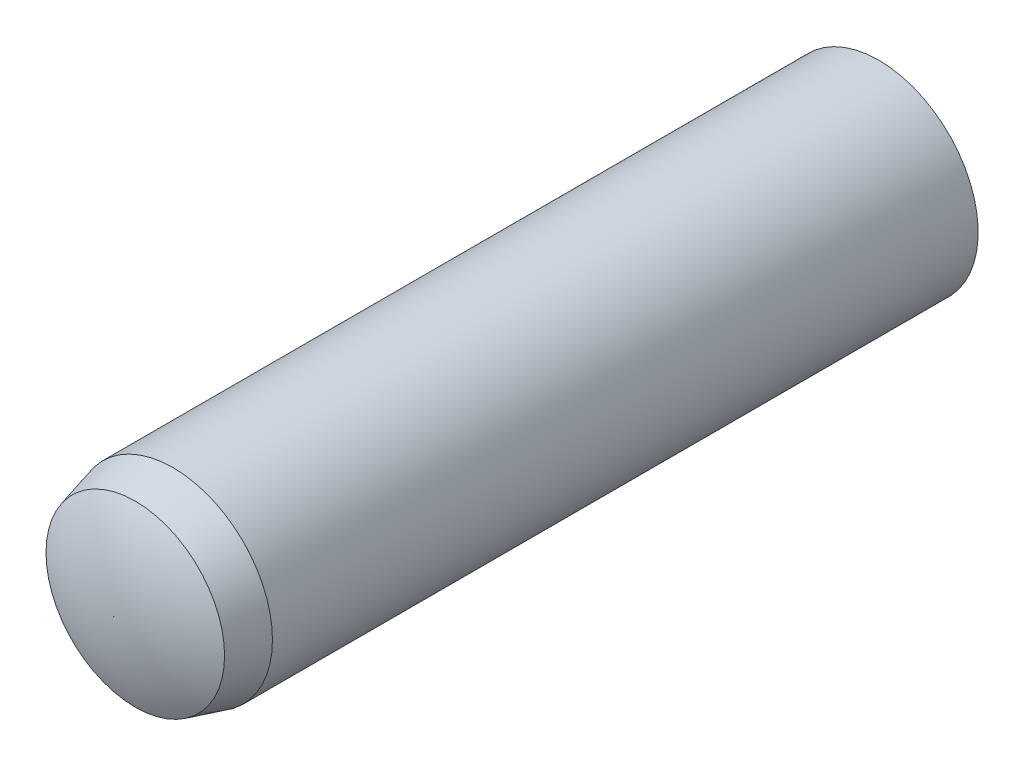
ISO-10303-21;
HEADER;
FILE_DESCRIPTION(('STEP AP214'),'2;1');
FILE_NAME('part.step','',(''),(''),'','','');
FILE_SCHEMA(('AUTOMOTIVE_DESIGN { 1 0 10303 214 1 1 1 1 }'));
ENDSEC;
DATA;
#1=APPLICATION_CONTEXT('core data for automotive mechanical design processes');
#2=APPLICATION_PROTOCOL_DEFINITION('international standard','automotive_design',2000,#1);
#3=PRODUCT_CONTEXT('',#1,'mechanical');
#4=PRODUCT('Part','Part','',(#3));
#5=PRODUCT_RELATED_PRODUCT_CATEGORY('part','',(#4));
#6=PRODUCT_DEFINITION_FORMATION('','',#4);
#7=PRODUCT_DEFINITION_CONTEXT('part definition',#1,'design');
#8=PRODUCT_DEFINITION('design','',#6,#7);
#9=PRODUCT_DEFINITION_SHAPE('','',#8);
#10=(LENGTH_UNIT() NAMED_UNIT(*) SI_UNIT(.MILLI.,.METRE.));
#11=(NAMED_UNIT(*) PLANE_ANGLE_UNIT() SI_UNIT($,.RADIAN.));
#12=(NAMED_UNIT(*) SI_UNIT($,.STERADIAN.) SOLID_ANGLE_UNIT());
#13=UNCERTAINTY_MEASURE_WITH_UNIT(LENGTH_MEASURE(1.E-05),#10,'distance_accuracy_value','');
#14=(GEOMETRIC_REPRESENTATION_CONTEXT(3) GLOBAL_UNCERTAINTY_ASSIGNED_CONTEXT((#13)) GLOBAL_UNIT_ASSIGNED_CONTEXT((#10,
#11,#12)) REPRESENTATION_CONTEXT('',''));
#15=CARTESIAN_POINT('',(0.,0.,0.));
#16=DIRECTION('',(0.,0.,1.));
#17=DIRECTION('',(1.,0.,0.));
#18=AXIS2_PLACEMENT_3D('',#15,#16,#17);
#19=CARTESIAN_POINT('',(0.,0.,20.));
#20=DIRECTION('',(0.,0.,-1.));
#21=DIRECTION('',(-1.,0.,0.));
#22=AXIS2_PLACEMENT_3D('',#19,#20,#21);
#23=CYLINDRICAL_SURFACE('',#22,5.);
#24=CARTESIAN_POINT('',(0.,0.,17.));
#25=DIRECTION('',(0.,0.,1.));
#26=DIRECTION('',(1.,0.,0.));
#27=AXIS2_PLACEMENT_3D('',#24,#25,#26);
#28=CIRCLE('',#27,5.);
#29=CARTESIAN_POINT('',(5.,0.,17.));
#30=VERTEX_POINT('',#29);
#31=EDGE_CURVE('E10',#30,#30,#28,.F.);
#32=ORIENTED_EDGE('',*,*,#31,.T.);
#33=EDGE_LOOP('',(#32));
#34=FACE_BOUND('',#33,.T.);
#35=CARTESIAN_POINT('',(0.,0.,-18.5));
#36=DIRECTION('',(0.,0.,1.));
#37=DIRECTION('',(1.,0.,0.));
#38=AXIS2_PLACEMENT_3D('',#35,#36,#37);
#39=CIRCLE('',#38,5.);
#40=CARTESIAN_POINT('',(0.,4.99999999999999,-18.5));
#41=VERTEX_POINT('',#40);
#42=EDGE_CURVE('E368',#41,#41,#39,.T.);
#43=ORIENTED_EDGE('',*,*,#42,.T.);
#44=EDGE_LOOP('',(#43));
#45=FACE_BOUND('',#44,.T.);
#46=ADVANCED_FACE('F346',(#34,#45),#23,.T.);
#47=CARTESIAN_POINT('',(0.,0.,20.));
#48=DIRECTION('',(0.,0.,-1.));
#49=DIRECTION('',(-1.,0.,0.));
#50=AXIS2_PLACEMENT_3D('',#47,#48,#49);
#51=CONICAL_SURFACE('',#50,4.19615242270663,0.261799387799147);
#52=ORIENTED_EDGE('',*,*,#31,.F.);
#53=EDGE_LOOP('',(#52));
#54=FACE_BOUND('',#53,.T.);
#55=CARTESIAN_POINT('',(0.,0.,18.9));
#56=DIRECTION('',(0.,0.,1.));
#57=DIRECTION('',(1.,0.,0.));
#58=AXIS2_PLACEMENT_3D('',#55,#56,#57);
#59=CIRCLE('',#58,4.49089653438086);
#60=CARTESIAN_POINT('',(0.,4.49089653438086,18.9));
#61=VERTEX_POINT('',#60);
#62=EDGE_CURVE('E358',#61,#61,#59,.T.);
#63=ORIENTED_EDGE('',*,*,#62,.F.);
#64=EDGE_LOOP('',(#63));
#65=FACE_BOUND('',#64,.T.);
#66=ADVANCED_FACE('F390',(#54,#65),#51,.T.);
#67=CARTESIAN_POINT('',(0.,0.,9.96513299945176));
#68=DIRECTION('',(0.,0.,1.));
#69=DIRECTION('',(0.,1.,0.));
#70=AXIS2_PLACEMENT_3D('',#67,#68,#69);
#71=SPHERICAL_SURFACE('',#70,10.);
#72=CARTESIAN_POINT('',(0.,0.,19.9651317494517));
#73=DIRECTION('',(0.,0.,1.));
#74=DIRECTION('',(1.,0.,0.));
#75=AXIS2_PLACEMENT_3D('',#72,#73,#74);
#76=CIRCLE('',#75,0.00499999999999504);
#77=CARTESIAN_POINT('',(0.,0.00500000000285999,19.9651317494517));
#78=VERTEX_POINT('',#77);
#79=EDGE_CURVE('E362',#78,#78,#76,.T.);
#80=CARTESIAN_POINT('',(0.,4.49089653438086,18.9));
#81=CARTESIAN_POINT('',(0.,4.44759536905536,18.9217643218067));
#82=CARTESIAN_POINT('',(0.,4.40413596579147,18.9432138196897));
#83=CARTESIAN_POINT('',(0.,4.31690992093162,18.9854787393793));
#84=CARTESIAN_POINT('',(0.,4.27314327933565,19.0062941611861));
#85=CARTESIAN_POINT('',(0.,4.18531199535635,19.0472865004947));
#86=CARTESIAN_POINT('',(0.,4.14124735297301,19.0674634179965));
#87=CARTESIAN_POINT('',(0.,4.05282938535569,19.107174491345));
#88=CARTESIAN_POINT('',(0.,4.00847606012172,19.1267086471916));
#89=CARTESIAN_POINT('',(0.,3.91949010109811,19.1651300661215));
#90=CARTESIAN_POINT('',(0.,3.87485746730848,19.1840173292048));
#91=CARTESIAN_POINT('',(0.,3.78532232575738,19.2211409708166));
#92=CARTESIAN_POINT('',(0.,3.74041981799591,19.2393773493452));
#93=CARTESIAN_POINT('',(0.,3.65035441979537,19.2751953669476));
#94=CARTESIAN_POINT('',(0.,3.60519152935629,19.2927770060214));
#95=CARTESIAN_POINT('',(0.,3.51461491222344,19.3272818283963));
#96=CARTESIAN_POINT('',(0.,3.46920118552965,19.3442050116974));
#97=CARTESIAN_POINT('',(0.,3.37813249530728,19.3773893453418));
#98=CARTESIAN_POINT('',(0.,3.3324775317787,19.3936504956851));
#99=CARTESIAN_POINT('',(0.,3.24093601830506,19.4255073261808));
#100=CARTESIAN_POINT('',(0.,3.19504946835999,19.4411030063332));
#101=CARTESIAN_POINT('',(0.,3.10305448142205,19.4716255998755));
#102=CARTESIAN_POINT('',(0.,3.05694604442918,19.4865525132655));
#103=CARTESIAN_POINT('',(0.,2.9645170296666,19.5157344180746));
#104=CARTESIAN_POINT('',(0.,2.9181964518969,19.5299894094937));
#105=CARTESIAN_POINT('',(0.,2.82535294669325,19.5578244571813));
#106=CARTESIAN_POINT('',(0.,2.7788300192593,19.5714045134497));
#107=CARTESIAN_POINT('',(0.,2.68559164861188,19.597886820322));
#108=CARTESIAN_POINT('',(0.,2.6388762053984,19.6107890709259));
#109=CARTESIAN_POINT('',(0.,2.54526267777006,19.635913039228));
#110=CARTESIAN_POINT('',(0.,2.4983645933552,19.6481347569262));
#111=CARTESIAN_POINT('',(0.,2.40439569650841,19.6718950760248));
#112=CARTESIAN_POINT('',(0.,2.35732488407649,19.6834336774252));
#113=CARTESIAN_POINT('',(0.,2.26302048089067,19.7058253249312));
#114=CARTESIAN_POINT('',(0.,2.21578689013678,19.7166783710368));
#115=CARTESIAN_POINT('',(0.,2.12116691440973,19.7376966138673));
#116=CARTESIAN_POINT('',(0.,2.07378052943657,19.747861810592));
#117=CARTESIAN_POINT('',(0.,1.9788649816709,19.7675022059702));
#118=CARTESIAN_POINT('',(0.,1.93133581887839,19.7769774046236));
#119=CARTESIAN_POINT('',(0.,1.83614476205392,19.7952358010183));
#120=CARTESIAN_POINT('',(0.,1.78848286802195,19.8040189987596));
#121=CARTESIAN_POINT('',(0.,1.69303642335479,19.8208915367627));
#122=CARTESIAN_POINT('',(0.,1.6452518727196,19.8289808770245));
#123=CARTESIAN_POINT('',(0.,1.54957021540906,19.8444639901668));
#124=CARTESIAN_POINT('',(0.,1.5016731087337,19.8518577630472));
#125=CARTESIAN_POINT('',(0.,1.40577646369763,19.8659481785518));
#126=CARTESIAN_POINT('',(0.,1.35777692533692,19.8726448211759));
#127=CARTESIAN_POINT('',(0.,1.26168556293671,19.8853395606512));
#128=CARTESIAN_POINT('',(0.,1.21359373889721,19.8913376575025));
#129=CARTESIAN_POINT('',(0.,1.117327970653,19.9026340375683));
#130=CARTESIAN_POINT('',(0.,1.06915402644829,19.9079323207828));
#131=CARTESIAN_POINT('',(0.,0.972734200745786,19.9178279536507));
#132=CARTESIAN_POINT('',(0.,0.924488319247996,19.922425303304));
#133=CARTESIAN_POINT('',(0.,0.827934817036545,19.9309180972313));
#134=CARTESIAN_POINT('',(0.,0.779627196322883,19.9348135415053));
#135=CARTESIAN_POINT('',(0.,0.682960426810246,19.941901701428));
#136=CARTESIAN_POINT('',(0.,0.634601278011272,19.9450944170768));
#137=CARTESIAN_POINT('',(0.,0.537841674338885,19.9507764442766));
#138=CARTESIAN_POINT('',(0.,0.489441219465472,19.9532657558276));
#139=CARTESIAN_POINT('',(0.,0.392609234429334,19.9575404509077));
#140=CARTESIAN_POINT('',(0.,0.344177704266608,19.9593258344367));
#141=CARTESIAN_POINT('',(0.,0.247293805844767,19.9621922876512));
#142=CARTESIAN_POINT('',(0.,0.198841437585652,19.9632733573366));
#143=CARTESIAN_POINT('',(0.,0.101926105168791,19.9647309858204));
#144=CARTESIAN_POINT('',(0.,0.053463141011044,19.9651075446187));
#145=CARTESIAN_POINT('',(0.,0.00500000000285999,19.9651317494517));
#146=B_SPLINE_CURVE_WITH_KNOTS('',3,(#80,#81,#82,#83,#84,#85,#86,#87,#88,#89,#90,#91,#92,#93,
#94,#95,#96,#97,#98,#99,#100,#101,#102,#103,#104,#105,#106,#107,#108,#109,#110,#111,#112,#113,
#114,#115,#116,#117,#118,#119,#120,#121,#122,#123,#124,#125,#126,#127,#128,#129,#130,#131,#132,
#133,#134,#135,#136,#137,#138,#139,#140,#141,#142,#143,#144,#145),.UNSPECIFIED.,.F.,.F.,(4,2,2,
2,2,2,2,2,2,2,2,2,2,2,2,2,2,2,2,2,2,2,2,2,2,2,2,2,2,2,2,2,4),(0.,0.145388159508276,
0.290776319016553,0.436164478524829,0.581552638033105,0.726940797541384,0.87232895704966,
1.01771711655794,1.16310527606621,1.30849343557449,1.45388159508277,1.59926975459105,
1.74465791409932,1.8900460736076,2.03543423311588,2.18082239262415,2.32621055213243,
2.47159871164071,2.61698687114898,2.76237503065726,2.90776319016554,3.05315134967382,
3.19853950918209,3.34392766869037,3.48931582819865,3.63470398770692,3.7800921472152,
3.92548030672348,4.07086846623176,4.21625662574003,4.36164478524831,4.50703294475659,
4.65242110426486),.UNSPECIFIED.);
#147=EDGE_CURVE('BSEAM394',#61,#78,#146,.T.);
#148=ORIENTED_EDGE('',*,*,#62,.T.);
#149=ORIENTED_EDGE('',*,*,#79,.F.);
#150=ORIENTED_EDGE('',*,*,#147,.T.);
#151=ORIENTED_EDGE('',*,*,#147,.F.);
#152=EDGE_LOOP('',(#148,#150,#149,#151));
#153=FACE_BOUND('',#152,.T.);
#154=ADVANCED_FACE('F394',(#153),#71,.T.);
#155=CARTESIAN_POINT('',(0.,0.,6.23644298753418));
#156=DIRECTION('',(0.,0.,1.));
#157=DIRECTION('',(1.,0.,0.));
#158=AXIS2_PLACEMENT_3D('',#155,#156,#157);
#159=CYLINDRICAL_SURFACE('',#158,0.00499999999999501);
#160=CARTESIAN_POINT('',(0.,0.,20.));
#161=DIRECTION('',(0.,0.,1.));
#162=DIRECTION('',(1.,0.,0.));
#163=AXIS2_PLACEMENT_3D('',#160,#161,#162);
#164=CIRCLE('',#163,0.00499999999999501);
#165=CARTESIAN_POINT('',(0.00499999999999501,0.,20.));
#166=VERTEX_POINT('',#165);
#167=EDGE_CURVE('E353',#166,#166,#164,.T.);
#168=ORIENTED_EDGE('',*,*,#167,.F.);
#169=EDGE_LOOP('',(#168));
#170=FACE_BOUND('',#169,.T.);
#171=ORIENTED_EDGE('',*,*,#79,.T.);
#172=EDGE_LOOP('',(#171));
#173=FACE_BOUND('',#172,.T.);
#174=ADVANCED_FACE('F400',(#170,#173),#159,.T.);
#175=CARTESIAN_POINT('',(0.,0.,20.));
#176=DIRECTION('',(0.,0.,1.));
#177=DIRECTION('',(1.,0.,0.));
#178=AXIS2_PLACEMENT_3D('',#175,#176,#177);
#179=PLANE('',#178);
#180=ORIENTED_EDGE('',*,*,#167,.T.);
#181=EDGE_LOOP('',(#180));
#182=FACE_BOUND('',#181,.T.);
#183=ADVANCED_FACE('F385',(#182),#179,.T.);
#184=CARTESIAN_POINT('',(0.,0.,6.23644298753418));
#185=DIRECTION('',(0.,0.,1.));
#186=DIRECTION('',(1.,0.,0.));
#187=AXIS2_PLACEMENT_3D('',#184,#185,#186);
#188=CYLINDRICAL_SURFACE('',#187,0.00499999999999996);
#189=CARTESIAN_POINT('',(0.,0.,-19.8397447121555));
#190=DIRECTION('',(0.,0.,1.));
#191=DIRECTION('',(1.,0.,0.));
#192=AXIS2_PLACEMENT_3D('',#189,#190,#191);
#193=CIRCLE('',#192,0.00499999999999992);
#194=CARTESIAN_POINT('',(0.,0.00499999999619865,-19.8397447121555));
#195=VERTEX_POINT('',#194);
#196=EDGE_CURVE('E365',#195,#195,#193,.T.);
#197=ORIENTED_EDGE('',*,*,#196,.F.);
#198=EDGE_LOOP('',(#197));
#199=FACE_BOUND('',#198,.T.);
#200=CARTESIAN_POINT('',(0.,0.,-20.));
#201=DIRECTION('',(0.,0.,1.));
#202=DIRECTION('',(1.,0.,0.));
#203=AXIS2_PLACEMENT_3D('',#200,#201,#202);
#204=CIRCLE('',#203,0.00499999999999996);
#205=CARTESIAN_POINT('',(0.00499999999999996,0.,-20.));
#206=VERTEX_POINT('',#205);
#207=EDGE_CURVE('E349',#206,#206,#204,.T.);
#208=ORIENTED_EDGE('',*,*,#207,.T.);
#209=EDGE_LOOP('',(#208));
#210=FACE_BOUND('',#209,.T.);
#211=ADVANCED_FACE('F376',(#199,#210),#188,.T.);
#212=CARTESIAN_POINT('',(0.,0.,-9.83974596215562));
#213=DIRECTION('',(0.,0.,1.));
#214=DIRECTION('',(0.,1.,0.));
#215=AXIS2_PLACEMENT_3D('',#212,#213,#214);
#216=SPHERICAL_SURFACE('',#215,10.);
#217=CARTESIAN_POINT('',(0.,0.00499999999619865,-19.8397447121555));
#218=CARTESIAN_POINT('',(0.,0.0594894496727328,-19.8397175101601));
#219=CARTESIAN_POINT('',(0.,0.113978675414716,-19.8392448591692));
#220=CARTESIAN_POINT('',(0.,0.222942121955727,-19.8374089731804));
#221=CARTESIAN_POINT('',(0.,0.277416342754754,-19.8360457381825));
#222=CARTESIAN_POINT('',(0.,0.386335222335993,-19.8324289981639));
#223=CARTESIAN_POINT('',(0.,0.440779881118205,-19.8301754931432));
#224=CARTESIAN_POINT('',(0.,0.549625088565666,-19.8247788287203));
#225=CARTESIAN_POINT('',(0.,0.604025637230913,-19.8216356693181));
#226=CARTESIAN_POINT('',(0.,0.712768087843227,-19.8144605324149));
#227=CARTESIAN_POINT('',(0.,0.767109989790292,-19.8104285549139));
#228=CARTESIAN_POINT('',(0.,0.875720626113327,-19.8014768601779));
#229=CARTESIAN_POINT('',(0.,0.929989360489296,-19.7965571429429));
#230=CARTESIAN_POINT('',(0.,1.0384391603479,-19.7858312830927));
#231=CARTESIAN_POINT('',(0.,1.09262022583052,-19.7800251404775));
#232=CARTESIAN_POINT('',(0.,1.20088021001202,-19.7675279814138));
#233=CARTESIAN_POINT('',(0.,1.25495912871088,-19.7608369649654));
#234=CARTESIAN_POINT('',(0.,1.36300036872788,-19.7465718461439));
#235=CARTESIAN_POINT('',(0.,1.41696269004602,-19.7389977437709));
#236=CARTESIAN_POINT('',(0.,1.52475631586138,-19.7229684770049));
#237=CARTESIAN_POINT('',(0.,1.5785876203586,-19.714513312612));
#238=CARTESIAN_POINT('',(0.,1.68610482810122,-19.6967241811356));
#239=CARTESIAN_POINT('',(0.,1.73979073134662,-19.6873902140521));
#240=CARTESIAN_POINT('',(0.,1.84700279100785,-19.6678459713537));
#241=CARTESIAN_POINT('',(0.,1.90052894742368,-19.6576356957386));
#242=CARTESIAN_POINT('',(0.,2.00740721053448,-19.6363415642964));
#243=CARTESIAN_POINT('',(0.,2.06075931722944,-19.6252577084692));
#244=CARTESIAN_POINT('',(0.,2.16727522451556,-19.6022193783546));
#245=CARTESIAN_POINT('',(0.,2.22043902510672,-19.590264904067));
#246=CARTESIAN_POINT('',(0.,2.32656411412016,-19.5654885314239));
#247=CARTESIAN_POINT('',(0.,2.37952540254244,-19.5526666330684));
#248=CARTESIAN_POINT('',(0.,2.48523131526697,-19.5261588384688));
#249=CARTESIAN_POINT('',(0.,2.53797593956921,-19.5124729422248));
#250=CARTESIAN_POINT('',(0.,2.64323442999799,-19.4842408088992));
#251=CARTESIAN_POINT('',(0.,2.69574829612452,-19.4696945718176));
#252=CARTESIAN_POINT('',(0.,2.80053123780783,-19.4397456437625));
#253=CARTESIAN_POINT('',(0.,2.8528003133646,-19.4243429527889));
#254=CARTESIAN_POINT('',(0.,2.95707970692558,-19.3926852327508));
#255=CARTESIAN_POINT('',(0.,3.00909002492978,-19.3764302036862));
#256=CARTESIAN_POINT('',(0.,3.11283800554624,-19.3430721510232));
#257=CARTESIAN_POINT('',(0.,3.16457566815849,-19.3259691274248));
#258=CARTESIAN_POINT('',(0.,3.26776451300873,-19.2909196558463));
#259=CARTESIAN_POINT('',(0.,3.31921569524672,-19.2729732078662));
#260=CARTESIAN_POINT('',(0.,3.42181783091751,-19.236241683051));
#261=CARTESIAN_POINT('',(0.,3.47296878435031,-19.2174566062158));
#262=CARTESIAN_POINT('',(0.,3.57495679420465,-19.179052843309));
#263=CARTESIAN_POINT('',(0.,3.62579385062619,-19.1594341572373));
#264=CARTESIAN_POINT('',(0.,3.72714048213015,-19.1193684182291));
#265=CARTESIAN_POINT('',(0.,3.77765005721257,-19.0989213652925));
#266=CARTESIAN_POINT('',(0.,3.87832822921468,-19.0572043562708));
#267=CARTESIAN_POINT('',(0.,3.92849682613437,-19.0359344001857));
#268=CARTESIAN_POINT('',(0.,4.02847963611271,-18.9925772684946));
#269=CARTESIAN_POINT('',(0.,4.07829384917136,-18.9704900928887));
#270=CARTESIAN_POINT('',(0.,4.17755458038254,-18.9255044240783));
#271=CARTESIAN_POINT('',(0.,4.22700109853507,-18.9026059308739));
#272=CARTESIAN_POINT('',(0.,4.32551322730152,-18.856003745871));
#273=CARTESIAN_POINT('',(0.,4.37457883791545,-18.8323000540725));
#274=CARTESIAN_POINT('',(0.,4.47231604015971,-18.7840938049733));
#275=CARTESIAN_POINT('',(0.,4.52098763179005,-18.7595912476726));
#276=CARTESIAN_POINT('',(0.,4.61792379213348,-18.70979381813));
#277=CARTESIAN_POINT('',(0.,4.66618836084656,-18.6844989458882));
#278=CARTESIAN_POINT('',(0.,4.76229757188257,-18.6331236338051));
#279=CARTESIAN_POINT('',(0.,4.81014221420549,-18.6070431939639));
#280=CARTESIAN_POINT('',(0.,4.90539881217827,-18.5541037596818));
#281=CARTESIAN_POINT('',(0.,4.95281076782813,-18.5272447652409));
#282=CARTESIAN_POINT('',(0.,4.99999999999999,-18.5));
#283=B_SPLINE_CURVE_WITH_KNOTS('',3,(#217,#218,#219,#220,#221,#222,#223,#224,#225,#226,#227,
#228,#229,#230,#231,#232,#233,#234,#235,#236,#237,#238,#239,#240,#241,#242,#243,#244,#245,#246,
#247,#248,#249,#250,#251,#252,#253,#254,#255,#256,#257,#258,#259,#260,#261,#262,#263,#264,#265,
#266,#267,#268,#269,#270,#271,#272,#273,#274,#275,#276,#277,#278,#279,#280,#281,#282),
.UNSPECIFIED.,.F.,.F.,(4,2,2,2,2,2,2,2,2,2,2,2,2,2,2,2,2,2,2,2,2,2,2,2,2,2,2,2,2,2,2,2,4),(0.,
0.163466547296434,0.32693309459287,0.490399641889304,0.653866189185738,0.817332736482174,
0.980799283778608,1.14426583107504,1.30773237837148,1.47119892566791,1.63466547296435,
1.79813202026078,1.96159856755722,2.12506511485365,2.28853166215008,2.45199820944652,
2.61546475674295,2.77893130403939,2.94239785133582,3.10586439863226,3.26933094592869,
3.43279749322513,3.59626404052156,3.759730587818,3.92319713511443,4.08666368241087,
4.2501302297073,4.41359677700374,4.57706332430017,4.74052987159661,4.90399641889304,
5.06746296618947,5.23092951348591),.UNSPECIFIED.);
#284=EDGE_CURVE('BSEAM373',#195,#41,#283,.T.);
#285=ORIENTED_EDGE('',*,*,#196,.T.);
#286=ORIENTED_EDGE('',*,*,#42,.F.);
#287=ORIENTED_EDGE('',*,*,#284,.T.);
#288=ORIENTED_EDGE('',*,*,#284,.F.);
#289=EDGE_LOOP('',(#285,#287,#286,#288));
#290=FACE_BOUND('',#289,.T.);
#291=ADVANCED_FACE('F373',(#290),#216,.T.);
#292=CARTESIAN_POINT('',(0.,0.,-20.));
#293=DIRECTION('',(0.,0.,1.));
#294=DIRECTION('',(1.,0.,0.));
#295=AXIS2_PLACEMENT_3D('',#292,#293,#294);
#296=PLANE('',#295);
#297=ORIENTED_EDGE('',*,*,#207,.F.);
#298=EDGE_LOOP('',(#297));
#299=FACE_BOUND('',#298,.T.);
#300=ADVANCED_FACE('F375',(#299),#296,.F.);
#301=CLOSED_SHELL('',(#46,#66,#154,#174,#183,#211,#291,#300));
#302=MANIFOLD_SOLID_BREP('B2',#301);
#303=ADVANCED_BREP_SHAPE_REPRESENTATION('',(#18,#302),#14);
#304=SHAPE_DEFINITION_REPRESENTATION(#9,#303);
ENDSEC;
END-ISO-10303-21;
